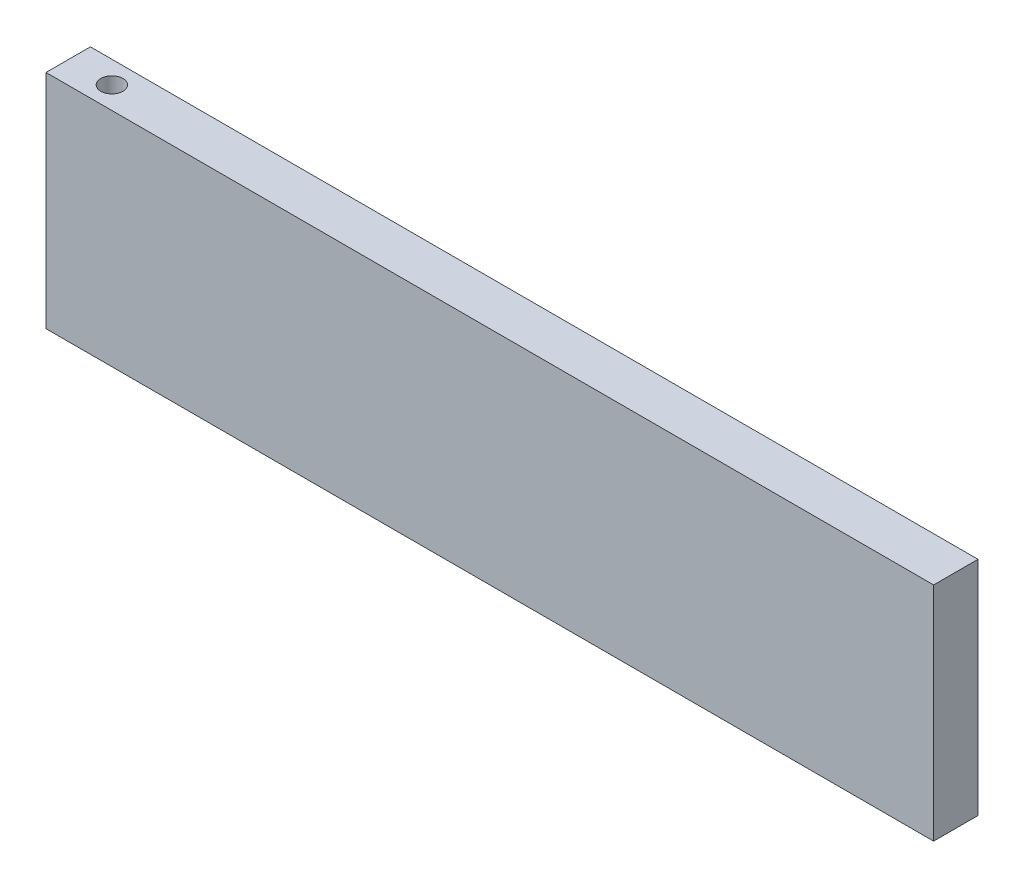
from build123d import *

# Parameters (mm, degrees)
SKETCH1_W                  = 508
SKETCH1_H                  = 127
EXTRUDE1_DEPTH             = 12.7
SKETCH2_R                  = 3.175
CUT_EXTRUDE2_DEPTH         = 285.264471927
DOUBLE_SYMMETRY_DEPTH      = 263.125046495
DOUBLE_SYMMETRY_DEPTH_BACK = 263.125046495


with BuildPart() as part:
    # Sketch1 → Extrude1 (new body)
    with BuildSketch(Plane.XY):
        Rectangle(SKETCH1_W, SKETCH1_H)
    extrude(amount=EXTRUDE1_DEPTH)

    # Sketch2 → Cut-Extrude2 (cut, through all)
    with BuildSketch(Plane.XZ.offset(63.5)):
        with Locations(Location((12.5, 6.35, 0), (0, 0, 270))):
            Circle(SKETCH2_R)
    cut_extrude2 = extrude(amount=-CUT_EXTRUDE2_DEPTH, mode=Mode.SUBTRACT)

    # Mirror1: Cut-Extrude2 across plane
    add(cut_extrude2.mirror(Plane(origin=(0, 0, 0), x_dir=(0, 0, 1), z_dir=(1, 0, 0))), mode=Mode.SUBTRACT)

    # Sketch3 → double symmetry (cut, two sides: drawn at the far end of the back side and taken through both)
    with BuildSketch(Plane.XY.offset(12.7).offset(-DOUBLE_SYMMETRY_DEPTH_BACK)):
        Polygon((0, -1097.406734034), (0, -63.5), (0, 0), (254, 0), (1287.906734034, 0), (-53.21408638, 1573.927407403), (-1341.120820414, 476.520673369), align=None)
    extrude(amount=DOUBLE_SYMMETRY_DEPTH + DOUBLE_SYMMETRY_DEPTH_BACK, mode=Mode.SUBTRACT)


solid = part.part
